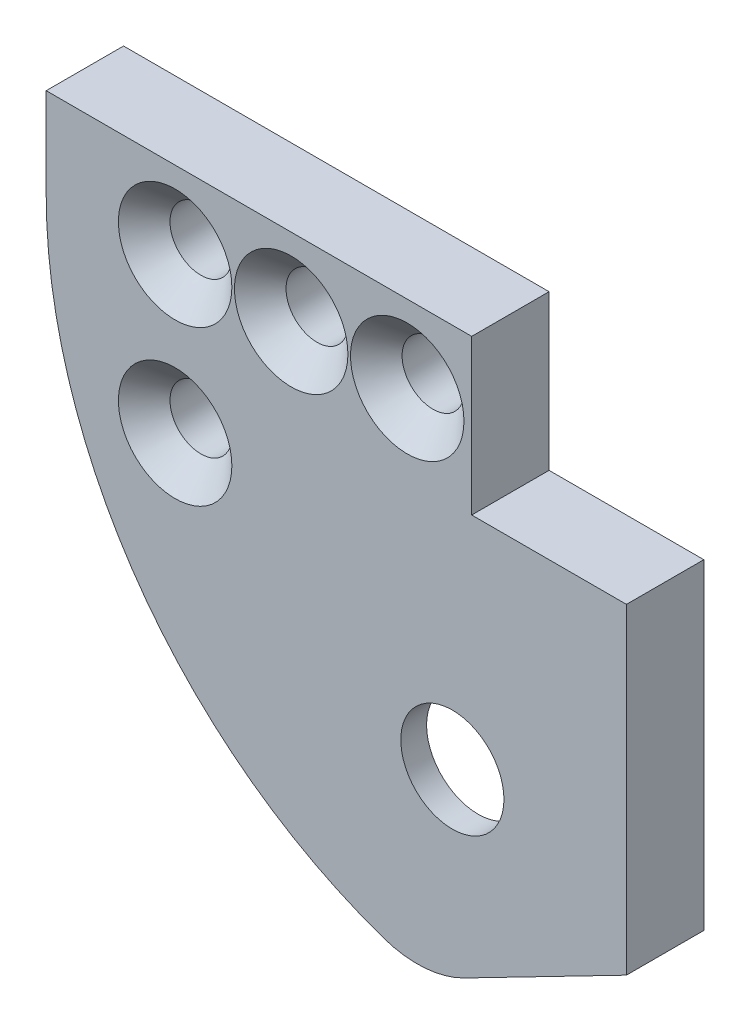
from build123d import *

# Parameters (mm, degrees)
BOSS_EXTRU_1_DEPTH                             = 3
FRAISAGE_POUR_VIS_T_TE_FRAIS_E_M21_D           = 2.4
FRAISAGE_POUR_VIS_T_TE_FRAIS_E_M21_CSINK_D     = 4.4
FRAISAGE_POUR_VIS_T_TE_FRAIS_E_M21_CSINK_ANGLE = 90
R_P_TITION_LIN_AIRE1_COUNT                     = 3
R_P_TITION_LIN_AIRE1_PITCH                     = 4.5
R_P_TITION_LIN_AIRE2_COUNT                     = 2
R_P_TITION_LIN_AIRE2_PITCH                     = 6
ENL_V_MAT_EXTRU_1_REACH                        = 82.585
ESQUISSE4_R                                    = 2
ESQUISSE5_R                                    = 5.5
ENL_V_MAT_EXTRU_2_DEPTH                        = 2
CONG_1_R                                       = 4


with BuildPart() as part:
    # Esquisse1 → Boss.-Extru.1 (new body)
    with BuildSketch(Plane.XY.offset(11)):
        with BuildLine():
            Line((32, 71), (32, 65))
            Line((32, 65), (38, 65))
            Line((38, 65), (38, 52.547750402))
            Line((38, 52.547750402), (30.292208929, 48.576821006))
            ThreePointArc((30.292208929, 48.576821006), (19.636863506, 55.490668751), (15.5, 67.5))
            Line((15.5, 67.5), (15.5, 71))
            Line((15.5, 71), (32, 71))
        make_face()
    extrude(amount=BOSS_EXTRU_1_DEPTH)

    # Fraisage pour vis _ t_te frais_e M21 (through all)
    with Locations(Plane.XY.offset(14)):
        with Locations((20.5, 68)):
            fraisage_pour_vis_t_te_frais_e_m21 = CounterSinkHole(FRAISAGE_POUR_VIS_T_TE_FRAIS_E_M21_D / 2, FRAISAGE_POUR_VIS_T_TE_FRAIS_E_M21_CSINK_D / 2, counter_sink_angle=FRAISAGE_POUR_VIS_T_TE_FRAIS_E_M21_CSINK_ANGLE)

    # R_p_tition lin_aire1: Fraisage pour vis _ t_te frais_e M21 ×3
    with Locations(*[(i * R_P_TITION_LIN_AIRE1_PITCH, 0, 0) for i in range(1, R_P_TITION_LIN_AIRE1_COUNT)]):
        add(fraisage_pour_vis_t_te_frais_e_m21, mode=Mode.SUBTRACT)

    # R_p_tition lin_aire2: Fraisage pour vis _ t_te frais_e M21 ×2
    with Locations(*[(0, -i * R_P_TITION_LIN_AIRE2_PITCH, 0) for i in range(1, R_P_TITION_LIN_AIRE2_COUNT)]):
        add(fraisage_pour_vis_t_te_frais_e_m21, mode=Mode.SUBTRACT)

    # Esquisse4 → Enl_v. mat.-Extru.1 (cut, up to next)
    with BuildSketch(Plane.XY.offset(14), mode=Mode.PRIVATE) as enl_v_mat_extru_1_sk1:
        with Locations((31.25, 56.075759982)):
            Circle(ESQUISSE4_R)
    enl_v_mat_extru_1_tool1 = extrude(enl_v_mat_extru_1_sk1.sketch, amount=-ENL_V_MAT_EXTRU_1_REACH, mode=Mode.PRIVATE) & part.part
    add(enl_v_mat_extru_1_tool1.solids().sort_by_distance((31.25, 56.07576, 14))[0], mode=Mode.SUBTRACT)

    # Esquisse5 → Enl_v. mat.-Extru.2 (cut)
    with BuildSketch(Plane(origin=(0, 0, 11), x_dir=(-1, 0, 0), z_dir=(0, 0, -1))):
        with Locations((-31.25, 56.075759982)):
            Circle(ESQUISSE5_R)
    extrude(amount=-ENL_V_MAT_EXTRU_2_DEPTH, mode=Mode.SUBTRACT)

    # Cong_1
    cong_1_edges = [part.edges().sort_by_distance(p)[0] for p in [
        (30.292208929, 48.576821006, 12.5),
    ]]
    fillet(cong_1_edges, radius=CONG_1_R)


solid = part.part
